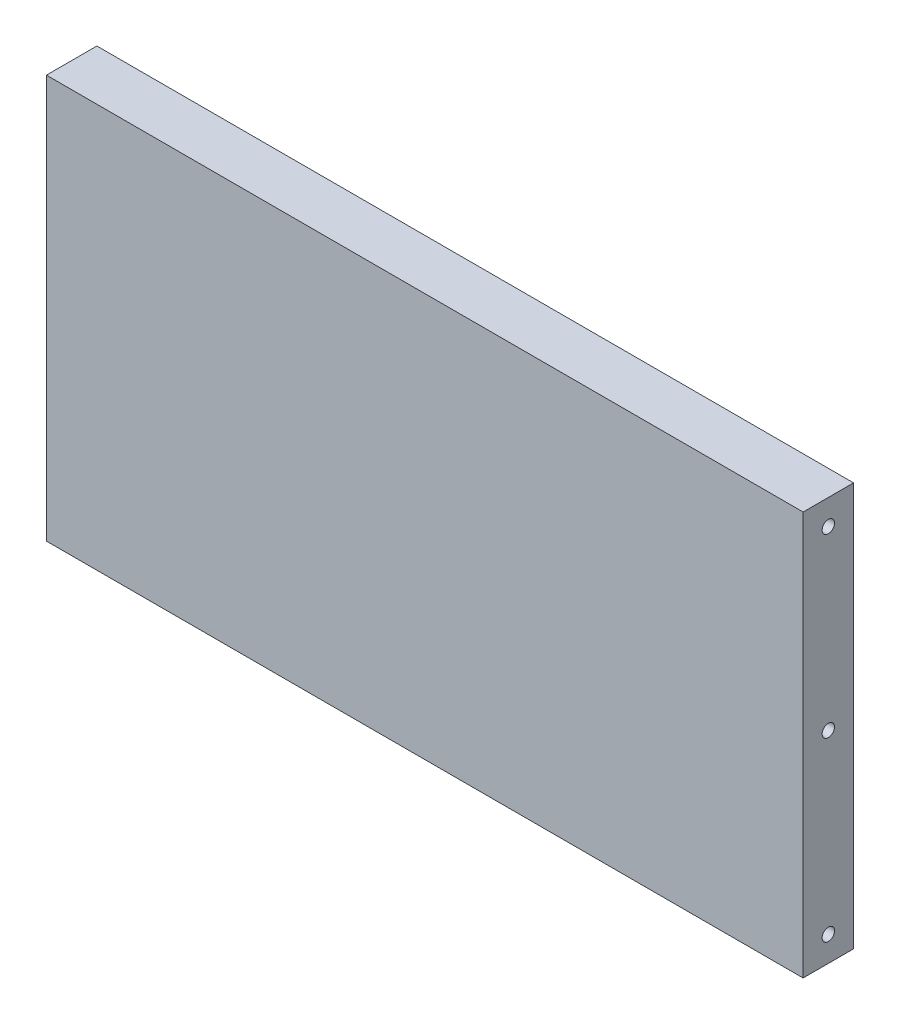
ISO-10303-21;
HEADER;
FILE_DESCRIPTION(('STEP AP214'),'2;1');
FILE_NAME('part.step','',(''),(''),'','','');
FILE_SCHEMA(('AUTOMOTIVE_DESIGN { 1 0 10303 214 1 1 1 1 }'));
ENDSEC;
DATA;
#1=APPLICATION_CONTEXT('core data for automotive mechanical design processes');
#2=APPLICATION_PROTOCOL_DEFINITION('international standard','automotive_design',2000,#1);
#3=PRODUCT_CONTEXT('',#1,'mechanical');
#4=PRODUCT('Part','Part','',(#3));
#5=PRODUCT_RELATED_PRODUCT_CATEGORY('part','',(#4));
#6=PRODUCT_DEFINITION_FORMATION('','',#4);
#7=PRODUCT_DEFINITION_CONTEXT('part definition',#1,'design');
#8=PRODUCT_DEFINITION('design','',#6,#7);
#9=PRODUCT_DEFINITION_SHAPE('','',#8);
#10=(LENGTH_UNIT() NAMED_UNIT(*) SI_UNIT(.MILLI.,.METRE.));
#11=(NAMED_UNIT(*) PLANE_ANGLE_UNIT() SI_UNIT($,.RADIAN.));
#12=(NAMED_UNIT(*) SI_UNIT($,.STERADIAN.) SOLID_ANGLE_UNIT());
#13=UNCERTAINTY_MEASURE_WITH_UNIT(LENGTH_MEASURE(1.E-05),#10,'distance_accuracy_value','');
#14=(GEOMETRIC_REPRESENTATION_CONTEXT(3) GLOBAL_UNCERTAINTY_ASSIGNED_CONTEXT((#13)) GLOBAL_UNIT_ASSIGNED_CONTEXT((#10,
#11,#12)) REPRESENTATION_CONTEXT('',''));
#15=CARTESIAN_POINT('',(0.,0.,0.));
#16=DIRECTION('',(0.,0.,1.));
#17=DIRECTION('',(1.,0.,0.));
#18=AXIS2_PLACEMENT_3D('',#15,#16,#17);
#19=CARTESIAN_POINT('',(-65.5556119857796,65.2272727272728,10.));
#20=DIRECTION('',(1.,0.,0.));
#21=DIRECTION('',(0.,1.,0.));
#22=AXIS2_PLACEMENT_3D('',#19,#20,#21);
#23=PLANE('',#22);
#24=CARTESIAN_POINT('',(-65.5556119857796,60.2272727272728,5.));
#25=DIRECTION('',(-1.,0.,0.));
#26=DIRECTION('',(0.,-1.,0.));
#27=AXIS2_PLACEMENT_3D('',#24,#25,#26);
#28=CIRCLE('',#27,1.23);
#29=CARTESIAN_POINT('',(-65.5556119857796,58.9972727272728,5.));
#30=VERTEX_POINT('',#29);
#31=EDGE_CURVE('E123',#30,#30,#28,.T.);
#32=ORIENTED_EDGE('',*,*,#31,.F.);
#33=EDGE_LOOP('',(#32));
#34=FACE_BOUND('',#33,.T.);
#35=CARTESIAN_POINT('',(-65.5556119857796,25.2272727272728,5.));
#36=DIRECTION('',(-1.,0.,0.));
#37=DIRECTION('',(0.,-1.,0.));
#38=AXIS2_PLACEMENT_3D('',#35,#36,#37);
#39=CIRCLE('',#38,1.23);
#40=CARTESIAN_POINT('',(-65.5556119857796,23.9972727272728,5.));
#41=VERTEX_POINT('',#40);
#42=EDGE_CURVE('E117',#41,#41,#39,.T.);
#43=ORIENTED_EDGE('',*,*,#42,.F.);
#44=EDGE_LOOP('',(#43));
#45=FACE_BOUND('',#44,.T.);
#46=CARTESIAN_POINT('',(-65.5556119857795,-9.77272727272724,5.00000000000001));
#47=DIRECTION('',(-1.,0.,0.));
#48=DIRECTION('',(0.,-1.,0.));
#49=AXIS2_PLACEMENT_3D('',#46,#47,#48);
#50=CIRCLE('',#49,1.23);
#51=CARTESIAN_POINT('',(-65.5556119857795,-11.0027272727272,5.00000000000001));
#52=VERTEX_POINT('',#51);
#53=EDGE_CURVE('E110',#52,#52,#50,.T.);
#54=ORIENTED_EDGE('',*,*,#53,.F.);
#55=EDGE_LOOP('',(#54));
#56=FACE_BOUND('',#55,.T.);
#57=DIRECTION('',(0.,-1.,0.));
#58=VECTOR('',#57,1.);
#59=CARTESIAN_POINT('',(-65.5556119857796,65.2272727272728,0.));
#60=LINE('',#59,#58);
#61=CARTESIAN_POINT('',(-65.5556119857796,65.2272727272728,0.));
#62=VERTEX_POINT('',#61);
#63=CARTESIAN_POINT('',(-65.5556119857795,-14.7727272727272,0.));
#64=VERTEX_POINT('',#63);
#65=EDGE_CURVE('E96',#62,#64,#60,.T.);
#66=ORIENTED_EDGE('',*,*,#65,.T.);
#67=DIRECTION('',(0.,0.,-1.));
#68=VECTOR('',#67,1.);
#69=CARTESIAN_POINT('',(-65.5556119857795,-14.7727272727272,10.));
#70=LINE('',#69,#68);
#71=CARTESIAN_POINT('',(-65.5556119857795,-14.7727272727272,10.));
#72=VERTEX_POINT('',#71);
#73=EDGE_CURVE('E11',#72,#64,#70,.T.);
#74=ORIENTED_EDGE('',*,*,#73,.F.);
#75=DIRECTION('',(0.,-1.,0.));
#76=VECTOR('',#75,1.);
#77=CARTESIAN_POINT('',(-65.5556119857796,65.2272727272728,10.));
#78=LINE('',#77,#76);
#79=CARTESIAN_POINT('',(-65.5556119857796,65.2272727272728,10.));
#80=VERTEX_POINT('',#79);
#81=EDGE_CURVE('E84',#80,#72,#78,.T.);
#82=ORIENTED_EDGE('',*,*,#81,.F.);
#83=DIRECTION('',(0.,0.,-1.));
#84=VECTOR('',#83,1.);
#85=CARTESIAN_POINT('',(-65.5556119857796,65.2272727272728,10.));
#86=LINE('',#85,#84);
#87=EDGE_CURVE('E92',#80,#62,#86,.T.);
#88=ORIENTED_EDGE('',*,*,#87,.T.);
#89=EDGE_LOOP('',(#66,#74,#82,#88));
#90=FACE_BOUND('',#89,.T.);
#91=ADVANCED_FACE('F33',(#34,#45,#56,#90),#23,.F.);
#92=CARTESIAN_POINT('',(-65.5556119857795,-14.7727272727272,10.));
#93=DIRECTION('',(0.,1.,0.));
#94=DIRECTION('',(0.,0.,1.));
#95=AXIS2_PLACEMENT_3D('',#92,#93,#94);
#96=PLANE('',#95);
#97=DIRECTION('',(1.,0.,0.));
#98=VECTOR('',#97,1.);
#99=CARTESIAN_POINT('',(-65.5556119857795,-14.7727272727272,0.));
#100=LINE('',#99,#98);
#101=CARTESIAN_POINT('',(84.4443880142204,-14.7727272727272,0.));
#102=VERTEX_POINT('',#101);
#103=EDGE_CURVE('E88',#64,#102,#100,.T.);
#104=ORIENTED_EDGE('',*,*,#103,.T.);
#105=DIRECTION('',(0.,0.,-1.));
#106=VECTOR('',#105,1.);
#107=CARTESIAN_POINT('',(84.4443880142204,-14.7727272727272,10.));
#108=LINE('',#107,#106);
#109=CARTESIAN_POINT('',(84.4443880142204,-14.7727272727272,10.));
#110=VERTEX_POINT('',#109);
#111=EDGE_CURVE('E41',#110,#102,#108,.T.);
#112=ORIENTED_EDGE('',*,*,#111,.F.);
#113=DIRECTION('',(1.,0.,0.));
#114=VECTOR('',#113,1.);
#115=CARTESIAN_POINT('',(-65.5556119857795,-14.7727272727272,10.));
#116=LINE('',#115,#114);
#117=EDGE_CURVE('E79',#72,#110,#116,.T.);
#118=ORIENTED_EDGE('',*,*,#117,.F.);
#119=ORIENTED_EDGE('',*,*,#73,.T.);
#120=EDGE_LOOP('',(#104,#112,#118,#119));
#121=FACE_BOUND('',#120,.T.);
#122=ADVANCED_FACE('F87',(#121),#96,.F.);
#123=CARTESIAN_POINT('',(84.4443880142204,65.2272727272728,10.));
#124=DIRECTION('',(-1.,0.,0.));
#125=DIRECTION('',(0.,-1.,0.));
#126=AXIS2_PLACEMENT_3D('',#123,#124,#125);
#127=PLANE('',#126);
#128=CARTESIAN_POINT('',(84.4443880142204,60.2272727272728,5.));
#129=DIRECTION('',(1.,0.,0.));
#130=DIRECTION('',(0.,1.,0.));
#131=AXIS2_PLACEMENT_3D('',#128,#129,#130);
#132=CIRCLE('',#131,1.23);
#133=CARTESIAN_POINT('',(84.4443880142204,61.4572727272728,5.));
#134=VERTEX_POINT('',#133);
#135=EDGE_CURVE('E140',#134,#134,#132,.T.);
#136=ORIENTED_EDGE('',*,*,#135,.F.);
#137=EDGE_LOOP('',(#136));
#138=FACE_BOUND('',#137,.T.);
#139=CARTESIAN_POINT('',(84.4443880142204,25.2272727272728,5.));
#140=DIRECTION('',(1.,0.,0.));
#141=DIRECTION('',(0.,1.,0.));
#142=AXIS2_PLACEMENT_3D('',#139,#140,#141);
#143=CIRCLE('',#142,1.23);
#144=CARTESIAN_POINT('',(84.4443880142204,26.4572727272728,5.));
#145=VERTEX_POINT('',#144);
#146=EDGE_CURVE('E134',#145,#145,#143,.T.);
#147=ORIENTED_EDGE('',*,*,#146,.F.);
#148=EDGE_LOOP('',(#147));
#149=FACE_BOUND('',#148,.T.);
#150=CARTESIAN_POINT('',(84.4443880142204,-9.77272727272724,4.99999999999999));
#151=DIRECTION('',(1.,0.,0.));
#152=DIRECTION('',(0.,1.,0.));
#153=AXIS2_PLACEMENT_3D('',#150,#151,#152);
#154=CIRCLE('',#153,1.23);
#155=CARTESIAN_POINT('',(84.4443880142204,-8.54272727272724,4.99999999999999));
#156=VERTEX_POINT('',#155);
#157=EDGE_CURVE('E128',#156,#156,#154,.T.);
#158=ORIENTED_EDGE('',*,*,#157,.F.);
#159=EDGE_LOOP('',(#158));
#160=FACE_BOUND('',#159,.T.);
#161=DIRECTION('',(0.,1.,0.));
#162=VECTOR('',#161,1.);
#163=CARTESIAN_POINT('',(84.4443880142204,65.2272727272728,0.));
#164=LINE('',#163,#162);
#165=CARTESIAN_POINT('',(84.4443880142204,65.2272727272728,0.));
#166=VERTEX_POINT('',#165);
#167=EDGE_CURVE('E66',#102,#166,#164,.T.);
#168=ORIENTED_EDGE('',*,*,#167,.T.);
#169=DIRECTION('',(0.,0.,-1.));
#170=VECTOR('',#169,1.);
#171=CARTESIAN_POINT('',(84.4443880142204,65.2272727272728,10.));
#172=LINE('',#171,#170);
#173=CARTESIAN_POINT('',(84.4443880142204,65.2272727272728,10.));
#174=VERTEX_POINT('',#173);
#175=EDGE_CURVE('E89',#174,#166,#172,.T.);
#176=ORIENTED_EDGE('',*,*,#175,.F.);
#177=DIRECTION('',(0.,1.,0.));
#178=VECTOR('',#177,1.);
#179=CARTESIAN_POINT('',(84.4443880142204,65.2272727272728,10.));
#180=LINE('',#179,#178);
#181=EDGE_CURVE('E82',#110,#174,#180,.T.);
#182=ORIENTED_EDGE('',*,*,#181,.F.);
#183=ORIENTED_EDGE('',*,*,#111,.T.);
#184=EDGE_LOOP('',(#168,#176,#182,#183));
#185=FACE_BOUND('',#184,.T.);
#186=ADVANCED_FACE('F90',(#138,#149,#160,#185),#127,.F.);
#187=CARTESIAN_POINT('',(-65.5556119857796,65.2272727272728,10.));
#188=DIRECTION('',(0.,-1.,0.));
#189=DIRECTION('',(0.,0.,-1.));
#190=AXIS2_PLACEMENT_3D('',#187,#188,#189);
#191=PLANE('',#190);
#192=DIRECTION('',(-1.,0.,0.));
#193=VECTOR('',#192,1.);
#194=CARTESIAN_POINT('',(-65.5556119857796,65.2272727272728,0.));
#195=LINE('',#194,#193);
#196=EDGE_CURVE('E72',#166,#62,#195,.T.);
#197=ORIENTED_EDGE('',*,*,#196,.T.);
#198=ORIENTED_EDGE('',*,*,#87,.F.);
#199=DIRECTION('',(-1.,0.,0.));
#200=VECTOR('',#199,1.);
#201=CARTESIAN_POINT('',(-65.5556119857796,65.2272727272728,10.));
#202=LINE('',#201,#200);
#203=EDGE_CURVE('E49',#174,#80,#202,.T.);
#204=ORIENTED_EDGE('',*,*,#203,.F.);
#205=ORIENTED_EDGE('',*,*,#175,.T.);
#206=EDGE_LOOP('',(#197,#198,#204,#205));
#207=FACE_BOUND('',#206,.T.);
#208=ADVANCED_FACE('F104',(#207),#191,.F.);
#209=CARTESIAN_POINT('',(0.,0.,10.));
#210=DIRECTION('',(0.,0.,1.));
#211=DIRECTION('',(1.,0.,0.));
#212=AXIS2_PLACEMENT_3D('',#209,#210,#211);
#213=PLANE('',#212);
#214=ORIENTED_EDGE('',*,*,#81,.T.);
#215=ORIENTED_EDGE('',*,*,#117,.T.);
#216=ORIENTED_EDGE('',*,*,#181,.T.);
#217=ORIENTED_EDGE('',*,*,#203,.T.);
#218=EDGE_LOOP('',(#214,#215,#216,#217));
#219=FACE_BOUND('',#218,.T.);
#220=ADVANCED_FACE('F80',(#219),#213,.T.);
#221=CARTESIAN_POINT('',(0.,0.,0.));
#222=DIRECTION('',(0.,0.,1.));
#223=DIRECTION('',(1.,0.,0.));
#224=AXIS2_PLACEMENT_3D('',#221,#222,#223);
#225=PLANE('',#224);
#226=ORIENTED_EDGE('',*,*,#65,.F.);
#227=ORIENTED_EDGE('',*,*,#196,.F.);
#228=ORIENTED_EDGE('',*,*,#167,.F.);
#229=ORIENTED_EDGE('',*,*,#103,.F.);
#230=EDGE_LOOP('',(#226,#227,#228,#229));
#231=FACE_BOUND('',#230,.T.);
#232=ADVANCED_FACE('F107',(#231),#225,.F.);
#233=CARTESIAN_POINT('',(-60.5556119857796,-9.77272727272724,5.00000000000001));
#234=DIRECTION('',(-1.,0.,0.));
#235=DIRECTION('',(0.,-1.,0.));
#236=AXIS2_PLACEMENT_3D('',#233,#234,#235);
#237=CYLINDRICAL_SURFACE('',#236,1.23);
#238=CARTESIAN_POINT('',(-60.5556119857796,-9.77272727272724,5.00000000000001));
#239=DIRECTION('',(-1.,0.,0.));
#240=DIRECTION('',(0.,-1.,0.));
#241=AXIS2_PLACEMENT_3D('',#238,#239,#240);
#242=CIRCLE('',#241,1.23);
#243=CARTESIAN_POINT('',(-60.5556119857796,-11.0027272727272,5.00000000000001));
#244=VERTEX_POINT('',#243);
#245=EDGE_CURVE('E113',#244,#244,#242,.T.);
#246=ORIENTED_EDGE('',*,*,#245,.F.);
#247=EDGE_LOOP('',(#246));
#248=FACE_BOUND('',#247,.T.);
#249=ORIENTED_EDGE('',*,*,#53,.T.);
#250=EDGE_LOOP('',(#249));
#251=FACE_BOUND('',#250,.T.);
#252=ADVANCED_FACE('F192',(#248,#251),#237,.F.);
#253=CARTESIAN_POINT('',(-60.5556119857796,-9.77272727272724,5.00000000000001));
#254=DIRECTION('',(-1.,0.,0.));
#255=DIRECTION('',(0.,-1.,0.));
#256=AXIS2_PLACEMENT_3D('',#253,#254,#255);
#257=PLANE('',#256);
#258=ORIENTED_EDGE('',*,*,#245,.T.);
#259=EDGE_LOOP('',(#258));
#260=FACE_BOUND('',#259,.T.);
#261=ADVANCED_FACE('F194',(#260),#257,.T.);
#262=CARTESIAN_POINT('',(-60.5556119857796,25.2272727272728,5.));
#263=DIRECTION('',(-1.,0.,0.));
#264=DIRECTION('',(0.,-1.,0.));
#265=AXIS2_PLACEMENT_3D('',#262,#263,#264);
#266=CYLINDRICAL_SURFACE('',#265,1.23);
#267=CARTESIAN_POINT('',(-60.5556119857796,25.2272727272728,5.));
#268=DIRECTION('',(-1.,0.,0.));
#269=DIRECTION('',(0.,-1.,0.));
#270=AXIS2_PLACEMENT_3D('',#267,#268,#269);
#271=CIRCLE('',#270,1.23);
#272=CARTESIAN_POINT('',(-60.5556119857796,23.9972727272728,5.));
#273=VERTEX_POINT('',#272);
#274=EDGE_CURVE('E120',#273,#273,#271,.T.);
#275=ORIENTED_EDGE('',*,*,#274,.F.);
#276=EDGE_LOOP('',(#275));
#277=FACE_BOUND('',#276,.T.);
#278=ORIENTED_EDGE('',*,*,#42,.T.);
#279=EDGE_LOOP('',(#278));
#280=FACE_BOUND('',#279,.T.);
#281=ADVANCED_FACE('F200',(#277,#280),#266,.F.);
#282=CARTESIAN_POINT('',(-60.5556119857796,25.2272727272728,5.));
#283=DIRECTION('',(-1.,0.,0.));
#284=DIRECTION('',(0.,-1.,0.));
#285=AXIS2_PLACEMENT_3D('',#282,#283,#284);
#286=PLANE('',#285);
#287=ORIENTED_EDGE('',*,*,#274,.T.);
#288=EDGE_LOOP('',(#287));
#289=FACE_BOUND('',#288,.T.);
#290=ADVANCED_FACE('F244',(#289),#286,.T.);
#291=CARTESIAN_POINT('',(-60.5556119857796,60.2272727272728,5.));
#292=DIRECTION('',(-1.,0.,0.));
#293=DIRECTION('',(0.,-1.,0.));
#294=AXIS2_PLACEMENT_3D('',#291,#292,#293);
#295=CYLINDRICAL_SURFACE('',#294,1.23);
#296=CARTESIAN_POINT('',(-60.5556119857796,60.2272727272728,5.));
#297=DIRECTION('',(-1.,0.,0.));
#298=DIRECTION('',(0.,-1.,0.));
#299=AXIS2_PLACEMENT_3D('',#296,#297,#298);
#300=CIRCLE('',#299,1.23);
#301=CARTESIAN_POINT('',(-60.5556119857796,58.9972727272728,5.));
#302=VERTEX_POINT('',#301);
#303=EDGE_CURVE('E99',#302,#302,#300,.T.);
#304=ORIENTED_EDGE('',*,*,#303,.F.);
#305=EDGE_LOOP('',(#304));
#306=FACE_BOUND('',#305,.T.);
#307=ORIENTED_EDGE('',*,*,#31,.T.);
#308=EDGE_LOOP('',(#307));
#309=FACE_BOUND('',#308,.T.);
#310=ADVANCED_FACE('F175',(#306,#309),#295,.F.);
#311=CARTESIAN_POINT('',(-60.5556119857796,60.2272727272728,5.));
#312=DIRECTION('',(-1.,0.,0.));
#313=DIRECTION('',(0.,-1.,0.));
#314=AXIS2_PLACEMENT_3D('',#311,#312,#313);
#315=PLANE('',#314);
#316=ORIENTED_EDGE('',*,*,#303,.T.);
#317=EDGE_LOOP('',(#316));
#318=FACE_BOUND('',#317,.T.);
#319=ADVANCED_FACE('F165',(#318),#315,.T.);
#320=CARTESIAN_POINT('',(79.4443880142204,-9.77272727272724,4.99999999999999));
#321=DIRECTION('',(1.,0.,0.));
#322=DIRECTION('',(0.,1.,0.));
#323=AXIS2_PLACEMENT_3D('',#320,#321,#322);
#324=CYLINDRICAL_SURFACE('',#323,1.23);
#325=CARTESIAN_POINT('',(79.4443880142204,-9.77272727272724,4.99999999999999));
#326=DIRECTION('',(1.,0.,0.));
#327=DIRECTION('',(0.,1.,0.));
#328=AXIS2_PLACEMENT_3D('',#325,#326,#327);
#329=CIRCLE('',#328,1.23);
#330=CARTESIAN_POINT('',(79.4443880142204,-8.54272727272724,4.99999999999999));
#331=VERTEX_POINT('',#330);
#332=EDGE_CURVE('E131',#331,#331,#329,.T.);
#333=ORIENTED_EDGE('',*,*,#332,.F.);
#334=EDGE_LOOP('',(#333));
#335=FACE_BOUND('',#334,.T.);
#336=ORIENTED_EDGE('',*,*,#157,.T.);
#337=EDGE_LOOP('',(#336));
#338=FACE_BOUND('',#337,.T.);
#339=ADVANCED_FACE('F162',(#335,#338),#324,.F.);
#340=CARTESIAN_POINT('',(79.4443880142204,-9.77272727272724,4.99999999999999));
#341=DIRECTION('',(1.,0.,0.));
#342=DIRECTION('',(0.,1.,0.));
#343=AXIS2_PLACEMENT_3D('',#340,#341,#342);
#344=PLANE('',#343);
#345=ORIENTED_EDGE('',*,*,#332,.T.);
#346=EDGE_LOOP('',(#345));
#347=FACE_BOUND('',#346,.T.);
#348=ADVANCED_FACE('F164',(#347),#344,.T.);
#349=CARTESIAN_POINT('',(79.4443880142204,25.2272727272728,5.));
#350=DIRECTION('',(1.,0.,0.));
#351=DIRECTION('',(0.,1.,0.));
#352=AXIS2_PLACEMENT_3D('',#349,#350,#351);
#353=CYLINDRICAL_SURFACE('',#352,1.23);
#354=CARTESIAN_POINT('',(79.4443880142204,25.2272727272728,5.));
#355=DIRECTION('',(1.,0.,0.));
#356=DIRECTION('',(0.,1.,0.));
#357=AXIS2_PLACEMENT_3D('',#354,#355,#356);
#358=CIRCLE('',#357,1.23);
#359=CARTESIAN_POINT('',(79.4443880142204,26.4572727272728,5.));
#360=VERTEX_POINT('',#359);
#361=EDGE_CURVE('E137',#360,#360,#358,.T.);
#362=ORIENTED_EDGE('',*,*,#361,.F.);
#363=EDGE_LOOP('',(#362));
#364=FACE_BOUND('',#363,.T.);
#365=ORIENTED_EDGE('',*,*,#146,.T.);
#366=EDGE_LOOP('',(#365));
#367=FACE_BOUND('',#366,.T.);
#368=ADVANCED_FACE('F172',(#364,#367),#353,.F.);
#369=CARTESIAN_POINT('',(79.4443880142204,25.2272727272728,5.));
#370=DIRECTION('',(1.,0.,0.));
#371=DIRECTION('',(0.,1.,0.));
#372=AXIS2_PLACEMENT_3D('',#369,#370,#371);
#373=PLANE('',#372);
#374=ORIENTED_EDGE('',*,*,#361,.T.);
#375=EDGE_LOOP('',(#374));
#376=FACE_BOUND('',#375,.T.);
#377=ADVANCED_FACE('F151',(#376),#373,.T.);
#378=CARTESIAN_POINT('',(79.4443880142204,60.2272727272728,5.));
#379=DIRECTION('',(1.,0.,0.));
#380=DIRECTION('',(0.,1.,0.));
#381=AXIS2_PLACEMENT_3D('',#378,#379,#380);
#382=CYLINDRICAL_SURFACE('',#381,1.23);
#383=CARTESIAN_POINT('',(79.4443880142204,60.2272727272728,5.));
#384=DIRECTION('',(1.,0.,0.));
#385=DIRECTION('',(0.,1.,0.));
#386=AXIS2_PLACEMENT_3D('',#383,#384,#385);
#387=CIRCLE('',#386,1.23);
#388=CARTESIAN_POINT('',(79.4443880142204,61.4572727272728,5.));
#389=VERTEX_POINT('',#388);
#390=EDGE_CURVE('E114',#389,#389,#387,.T.);
#391=ORIENTED_EDGE('',*,*,#390,.F.);
#392=EDGE_LOOP('',(#391));
#393=FACE_BOUND('',#392,.T.);
#394=ORIENTED_EDGE('',*,*,#135,.T.);
#395=EDGE_LOOP('',(#394));
#396=FACE_BOUND('',#395,.T.);
#397=ADVANCED_FACE('F148',(#393,#396),#382,.F.);
#398=CARTESIAN_POINT('',(79.4443880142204,60.2272727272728,5.));
#399=DIRECTION('',(1.,0.,0.));
#400=DIRECTION('',(0.,1.,0.));
#401=AXIS2_PLACEMENT_3D('',#398,#399,#400);
#402=PLANE('',#401);
#403=ORIENTED_EDGE('',*,*,#390,.T.);
#404=EDGE_LOOP('',(#403));
#405=FACE_BOUND('',#404,.T.);
#406=ADVANCED_FACE('F146',(#405),#402,.T.);
#407=CLOSED_SHELL('',(#91,#122,#186,#208,#220,#232,#252,#261,#281,#290,#310,#319,#339,#348,#368,
#377,#397,#406));
#408=MANIFOLD_SOLID_BREP('B2',#407);
#409=ADVANCED_BREP_SHAPE_REPRESENTATION('',(#18,#408),#14);
#410=SHAPE_DEFINITION_REPRESENTATION(#9,#409);
ENDSEC;
END-ISO-10303-21;
